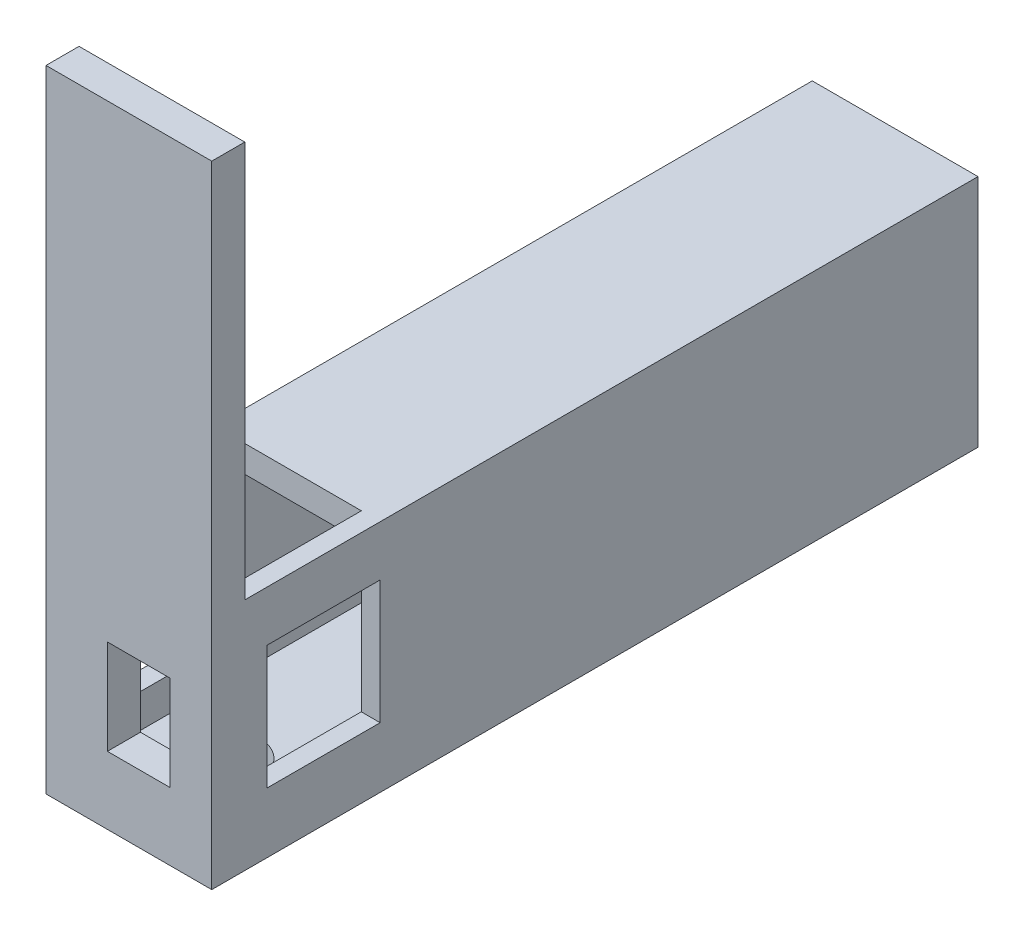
ISO-10303-21;
HEADER;
FILE_DESCRIPTION(('STEP AP214'),'2;1');
FILE_NAME('part.step','',(''),(''),'','','');
FILE_SCHEMA(('AUTOMOTIVE_DESIGN { 1 0 10303 214 1 1 1 1 }'));
ENDSEC;
DATA;
#1=APPLICATION_CONTEXT('core data for automotive mechanical design processes');
#2=APPLICATION_PROTOCOL_DEFINITION('international standard','automotive_design',2000,#1);
#3=PRODUCT_CONTEXT('',#1,'mechanical');
#4=PRODUCT('Part','Part','',(#3));
#5=PRODUCT_RELATED_PRODUCT_CATEGORY('part','',(#4));
#6=PRODUCT_DEFINITION_FORMATION('','',#4);
#7=PRODUCT_DEFINITION_CONTEXT('part definition',#1,'design');
#8=PRODUCT_DEFINITION('design','',#6,#7);
#9=PRODUCT_DEFINITION_SHAPE('','',#8);
#10=(LENGTH_UNIT() NAMED_UNIT(*) SI_UNIT(.MILLI.,.METRE.));
#11=(NAMED_UNIT(*) PLANE_ANGLE_UNIT() SI_UNIT($,.RADIAN.));
#12=(NAMED_UNIT(*) SI_UNIT($,.STERADIAN.) SOLID_ANGLE_UNIT());
#13=UNCERTAINTY_MEASURE_WITH_UNIT(LENGTH_MEASURE(1.E-05),#10,'distance_accuracy_value','');
#14=(GEOMETRIC_REPRESENTATION_CONTEXT(3) GLOBAL_UNCERTAINTY_ASSIGNED_CONTEXT((#13)) GLOBAL_UNIT_ASSIGNED_CONTEXT((#10,
#11,#12)) REPRESENTATION_CONTEXT('',''));
#15=CARTESIAN_POINT('',(0.,0.,0.));
#16=DIRECTION('',(0.,0.,1.));
#17=DIRECTION('',(1.,0.,0.));
#18=AXIS2_PLACEMENT_3D('',#15,#16,#17);
#19=CARTESIAN_POINT('',(24.554045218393,147.590841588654,-221.8957138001));
#20=DIRECTION('',(1.,0.,0.));
#21=DIRECTION('',(0.,1.,0.));
#22=AXIS2_PLACEMENT_3D('',#19,#20,#21);
#23=PLANE('',#22);
#24=DIRECTION('',(0.,1.,0.));
#25=VECTOR('',#24,1.);
#26=CARTESIAN_POINT('',(24.554045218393,147.590841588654,-40.9599363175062));
#27=LINE('',#26,#25);
#28=CARTESIAN_POINT('',(24.554045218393,165.867586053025,-40.9599363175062));
#29=VERTEX_POINT('',#28);
#30=CARTESIAN_POINT('',(24.554045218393,203.288707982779,-40.9599363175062));
#31=VERTEX_POINT('',#30);
#32=EDGE_CURVE('E289',#29,#31,#27,.T.);
#33=ORIENTED_EDGE('',*,*,#32,.F.);
#34=DIRECTION('',(0.,0.,-1.));
#35=VECTOR('',#34,1.);
#36=CARTESIAN_POINT('',(24.554045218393,165.867586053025,-221.8957138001));
#37=LINE('',#36,#35);
#38=CARTESIAN_POINT('',(24.554045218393,165.867586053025,-6.69277563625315));
#39=VERTEX_POINT('',#38);
#40=EDGE_CURVE('E342',#39,#29,#37,.T.);
#41=ORIENTED_EDGE('',*,*,#40,.F.);
#42=DIRECTION('',(0.,-1.,0.));
#43=VECTOR('',#42,1.);
#44=CARTESIAN_POINT('',(24.554045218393,147.590841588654,-6.69277563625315));
#45=LINE('',#44,#43);
#46=CARTESIAN_POINT('',(24.554045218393,203.288707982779,-6.69277563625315));
#47=VERTEX_POINT('',#46);
#48=EDGE_CURVE('E347',#47,#39,#45,.T.);
#49=ORIENTED_EDGE('',*,*,#48,.F.);
#50=DIRECTION('',(0.,0.,1.));
#51=VECTOR('',#50,1.);
#52=CARTESIAN_POINT('',(24.554045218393,203.288707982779,-221.8957138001));
#53=LINE('',#52,#51);
#54=EDGE_CURVE('E353',#31,#47,#53,.T.);
#55=ORIENTED_EDGE('',*,*,#54,.F.);
#56=EDGE_LOOP('',(#33,#41,#49,#55));
#57=FACE_BOUND('',#56,.T.);
#58=DIRECTION('',(0.,0.,1.));
#59=VECTOR('',#58,1.);
#60=CARTESIAN_POINT('',(24.554045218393,218.536949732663,-221.8957138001));
#61=LINE('',#60,#59);
#62=CARTESIAN_POINT('',(24.554045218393,218.536949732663,-221.8957138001));
#63=VERTEX_POINT('',#62);
#64=CARTESIAN_POINT('',(24.554045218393,218.536949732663,0.));
#65=VERTEX_POINT('',#64);
#66=EDGE_CURVE('E243',#63,#65,#61,.T.);
#67=ORIENTED_EDGE('',*,*,#66,.T.);
#68=DIRECTION('',(0.,-1.,0.));
#69=VECTOR('',#68,1.);
#70=CARTESIAN_POINT('',(24.554045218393,338.536949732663,0.));
#71=LINE('',#70,#69);
#72=CARTESIAN_POINT('',(24.554045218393,338.536949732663,0.));
#73=VERTEX_POINT('',#72);
#74=EDGE_CURVE('E248',#73,#65,#71,.T.);
#75=ORIENTED_EDGE('',*,*,#74,.F.);
#76=DIRECTION('',(0.,0.,-1.));
#77=VECTOR('',#76,1.);
#78=CARTESIAN_POINT('',(24.554045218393,338.536949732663,10.));
#79=LINE('',#78,#77);
#80=CARTESIAN_POINT('',(24.554045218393,338.536949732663,10.));
#81=VERTEX_POINT('',#80);
#82=EDGE_CURVE('E227',#81,#73,#79,.T.);
#83=ORIENTED_EDGE('',*,*,#82,.F.);
#84=DIRECTION('',(0.,1.,0.));
#85=VECTOR('',#84,1.);
#86=CARTESIAN_POINT('',(24.554045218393,218.536949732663,10.));
#87=LINE('',#86,#85);
#88=CARTESIAN_POINT('',(24.554045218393,147.590841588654,10.));
#89=VERTEX_POINT('',#88);
#90=EDGE_CURVE('E308',#89,#81,#87,.T.);
#91=ORIENTED_EDGE('',*,*,#90,.F.);
#92=DIRECTION('',(0.,0.,1.));
#93=VECTOR('',#92,1.);
#94=CARTESIAN_POINT('',(24.554045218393,147.590841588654,-221.8957138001));
#95=LINE('',#94,#93);
#96=CARTESIAN_POINT('',(24.554045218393,147.590841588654,-221.8957138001));
#97=VERTEX_POINT('',#96);
#98=EDGE_CURVE('E309',#97,#89,#95,.T.);
#99=ORIENTED_EDGE('',*,*,#98,.F.);
#100=DIRECTION('',(0.,1.,0.));
#101=VECTOR('',#100,1.);
#102=CARTESIAN_POINT('',(24.554045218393,147.590841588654,-221.8957138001));
#103=LINE('',#102,#101);
#104=EDGE_CURVE('E296',#97,#63,#103,.T.);
#105=ORIENTED_EDGE('',*,*,#104,.T.);
#106=EDGE_LOOP('',(#67,#75,#83,#91,#99,#105));
#107=FACE_BOUND('',#106,.T.);
#108=ADVANCED_FACE('F32',(#57,#107),#23,.T.);
#109=CARTESIAN_POINT('',(-25.6078665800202,147.590841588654,-221.8957138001));
#110=DIRECTION('',(0.,-1.,0.));
#111=DIRECTION('',(0.,0.,-1.));
#112=AXIS2_PLACEMENT_3D('',#109,#110,#111);
#113=PLANE('',#112);
#114=CARTESIAN_POINT('',(0.,147.590841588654,-18.05));
#115=DIRECTION('',(0.,-1.,0.));
#116=DIRECTION('',(0.,0.,-1.));
#117=AXIS2_PLACEMENT_3D('',#114,#115,#116);
#118=CIRCLE('',#117,10.8502852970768);
#119=CARTESIAN_POINT('',(0.,147.590841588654,-28.9002852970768));
#120=VERTEX_POINT('',#119);
#121=EDGE_CURVE('E359',#120,#120,#118,.T.);
#122=ORIENTED_EDGE('',*,*,#121,.F.);
#123=EDGE_LOOP('',(#122));
#124=FACE_BOUND('',#123,.T.);
#125=ORIENTED_EDGE('',*,*,#98,.T.);
#126=DIRECTION('',(1.,0.,0.));
#127=VECTOR('',#126,1.);
#128=CARTESIAN_POINT('',(-25.6078665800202,147.590841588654,10.));
#129=LINE('',#128,#127);
#130=CARTESIAN_POINT('',(-25.6078665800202,147.590841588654,10.));
#131=VERTEX_POINT('',#130);
#132=EDGE_CURVE('E312',#131,#89,#129,.T.);
#133=ORIENTED_EDGE('',*,*,#132,.F.);
#134=DIRECTION('',(0.,0.,1.));
#135=VECTOR('',#134,1.);
#136=CARTESIAN_POINT('',(-25.6078665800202,147.590841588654,-221.8957138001));
#137=LINE('',#136,#135);
#138=CARTESIAN_POINT('',(-25.6078665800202,147.590841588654,-221.8957138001));
#139=VERTEX_POINT('',#138);
#140=EDGE_CURVE('E400',#139,#131,#137,.T.);
#141=ORIENTED_EDGE('',*,*,#140,.F.);
#142=DIRECTION('',(1.,0.,0.));
#143=VECTOR('',#142,1.);
#144=CARTESIAN_POINT('',(-25.6078665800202,147.590841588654,-221.8957138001));
#145=LINE('',#144,#143);
#146=EDGE_CURVE('E301',#139,#97,#145,.T.);
#147=ORIENTED_EDGE('',*,*,#146,.T.);
#148=EDGE_LOOP('',(#125,#133,#141,#147));
#149=FACE_BOUND('',#148,.T.);
#150=ADVANCED_FACE('F277',(#124,#149),#113,.T.);
#151=CARTESIAN_POINT('',(-25.6078665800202,147.590841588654,-221.8957138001));
#152=DIRECTION('',(-1.,0.,0.));
#153=DIRECTION('',(0.,0.,1.));
#154=AXIS2_PLACEMENT_3D('',#151,#152,#153);
#155=PLANE('',#154);
#156=DIRECTION('',(0.,-1.,0.));
#157=VECTOR('',#156,1.);
#158=CARTESIAN_POINT('',(-25.6078665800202,165.867586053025,-40.9599363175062));
#159=LINE('',#158,#157);
#160=CARTESIAN_POINT('',(-25.6078665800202,203.288707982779,-40.9599363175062));
#161=VERTEX_POINT('',#160);
#162=CARTESIAN_POINT('',(-25.6078665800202,165.867586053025,-40.9599363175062));
#163=VERTEX_POINT('',#162);
#164=EDGE_CURVE('E311',#161,#163,#159,.T.);
#165=ORIENTED_EDGE('',*,*,#164,.F.);
#166=DIRECTION('',(0.,0.,-1.));
#167=VECTOR('',#166,1.);
#168=CARTESIAN_POINT('',(-25.6078665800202,203.288707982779,-40.9599363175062));
#169=LINE('',#168,#167);
#170=CARTESIAN_POINT('',(-25.6078665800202,203.288707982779,-6.69277563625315));
#171=VERTEX_POINT('',#170);
#172=EDGE_CURVE('E323',#171,#161,#169,.T.);
#173=ORIENTED_EDGE('',*,*,#172,.F.);
#174=DIRECTION('',(0.,1.,0.));
#175=VECTOR('',#174,1.);
#176=CARTESIAN_POINT('',(-25.6078665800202,165.867586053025,-6.69277563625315));
#177=LINE('',#176,#175);
#178=CARTESIAN_POINT('',(-25.6078665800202,165.867586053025,-6.69277563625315));
#179=VERTEX_POINT('',#178);
#180=EDGE_CURVE('E320',#179,#171,#177,.T.);
#181=ORIENTED_EDGE('',*,*,#180,.F.);
#182=DIRECTION('',(0.,0.,1.));
#183=VECTOR('',#182,1.);
#184=CARTESIAN_POINT('',(-25.6078665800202,165.867586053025,-40.9599363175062));
#185=LINE('',#184,#183);
#186=EDGE_CURVE('E314',#163,#179,#185,.T.);
#187=ORIENTED_EDGE('',*,*,#186,.F.);
#188=EDGE_LOOP('',(#165,#173,#181,#187));
#189=FACE_BOUND('',#188,.T.);
#190=ORIENTED_EDGE('',*,*,#140,.T.);
#191=DIRECTION('',(0.,-1.,0.));
#192=VECTOR('',#191,1.);
#193=CARTESIAN_POINT('',(-25.6078665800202,218.536949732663,10.));
#194=LINE('',#193,#192);
#195=CARTESIAN_POINT('',(-25.6078665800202,338.536949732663,10.));
#196=VERTEX_POINT('',#195);
#197=EDGE_CURVE('E253',#196,#131,#194,.T.);
#198=ORIENTED_EDGE('',*,*,#197,.F.);
#199=DIRECTION('',(0.,0.,1.));
#200=VECTOR('',#199,1.);
#201=CARTESIAN_POINT('',(-25.6078665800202,338.536949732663,10.));
#202=LINE('',#201,#200);
#203=CARTESIAN_POINT('',(-25.6078665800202,338.536949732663,0.));
#204=VERTEX_POINT('',#203);
#205=EDGE_CURVE('E221',#204,#196,#202,.T.);
#206=ORIENTED_EDGE('',*,*,#205,.F.);
#207=DIRECTION('',(0.,-1.,0.));
#208=VECTOR('',#207,1.);
#209=CARTESIAN_POINT('',(-25.6078665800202,338.536949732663,0.));
#210=LINE('',#209,#208);
#211=CARTESIAN_POINT('',(-25.6078665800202,218.536949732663,0.));
#212=VERTEX_POINT('',#211);
#213=EDGE_CURVE('E231',#204,#212,#210,.T.);
#214=ORIENTED_EDGE('',*,*,#213,.T.);
#215=DIRECTION('',(0.,0.,1.));
#216=VECTOR('',#215,1.);
#217=CARTESIAN_POINT('',(-25.6078665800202,218.536949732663,-221.8957138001));
#218=LINE('',#217,#216);
#219=CARTESIAN_POINT('',(-25.6078665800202,218.536949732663,-221.8957138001));
#220=VERTEX_POINT('',#219);
#221=EDGE_CURVE('E300',#220,#212,#218,.T.);
#222=ORIENTED_EDGE('',*,*,#221,.F.);
#223=DIRECTION('',(0.,-1.,0.));
#224=VECTOR('',#223,1.);
#225=CARTESIAN_POINT('',(-25.6078665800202,147.590841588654,-221.8957138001));
#226=LINE('',#225,#224);
#227=EDGE_CURVE('E451',#220,#139,#226,.T.);
#228=ORIENTED_EDGE('',*,*,#227,.T.);
#229=EDGE_LOOP('',(#190,#198,#206,#214,#222,#228));
#230=FACE_BOUND('',#229,.T.);
#231=ADVANCED_FACE('F282',(#189,#230),#155,.T.);
#232=CARTESIAN_POINT('',(-25.6078665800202,218.536949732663,-221.8957138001));
#233=DIRECTION('',(0.,1.,0.));
#234=DIRECTION('',(0.,0.,1.));
#235=AXIS2_PLACEMENT_3D('',#232,#233,#234);
#236=PLANE('',#235);
#237=DIRECTION('',(-1.,0.,0.));
#238=VECTOR('',#237,1.);
#239=CARTESIAN_POINT('',(-25.6078665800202,218.536949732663,0.));
#240=LINE('',#239,#238);
#241=CARTESIAN_POINT('',(18.8431850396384,218.536949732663,0.));
#242=VERTEX_POINT('',#241);
#243=EDGE_CURVE('E218',#65,#242,#240,.T.);
#244=ORIENTED_EDGE('',*,*,#243,.F.);
#245=ORIENTED_EDGE('',*,*,#66,.F.);
#246=DIRECTION('',(-1.,0.,0.));
#247=VECTOR('',#246,1.);
#248=CARTESIAN_POINT('',(-25.6078665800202,218.536949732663,-221.8957138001));
#249=LINE('',#248,#247);
#250=EDGE_CURVE('E449',#63,#220,#249,.T.);
#251=ORIENTED_EDGE('',*,*,#250,.T.);
#252=ORIENTED_EDGE('',*,*,#221,.T.);
#253=CARTESIAN_POINT('',(-19.8970064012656,218.536949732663,0.));
#254=VERTEX_POINT('',#253);
#255=EDGE_CURVE('E237',#254,#212,#240,.T.);
#256=ORIENTED_EDGE('',*,*,#255,.F.);
#257=DIRECTION('',(0.,0.,1.));
#258=VECTOR('',#257,1.);
#259=CARTESIAN_POINT('',(-19.8970064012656,218.536949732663,0.));
#260=LINE('',#259,#258);
#261=CARTESIAN_POINT('',(-19.8970064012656,218.536949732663,-41.));
#262=VERTEX_POINT('',#261);
#263=EDGE_CURVE('E397',#262,#254,#260,.T.);
#264=ORIENTED_EDGE('',*,*,#263,.F.);
#265=DIRECTION('',(-1.,0.,0.));
#266=VECTOR('',#265,1.);
#267=CARTESIAN_POINT('',(-19.8970064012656,218.536949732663,-41.));
#268=LINE('',#267,#266);
#269=CARTESIAN_POINT('',(18.8431850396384,218.536949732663,-41.));
#270=VERTEX_POINT('',#269);
#271=EDGE_CURVE('E363',#270,#262,#268,.T.);
#272=ORIENTED_EDGE('',*,*,#271,.F.);
#273=DIRECTION('',(0.,0.,-1.));
#274=VECTOR('',#273,1.);
#275=CARTESIAN_POINT('',(18.8431850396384,218.536949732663,0.));
#276=LINE('',#275,#274);
#277=EDGE_CURVE('E367',#242,#270,#276,.T.);
#278=ORIENTED_EDGE('',*,*,#277,.F.);
#279=EDGE_LOOP('',(#244,#245,#251,#252,#256,#264,#272,#278));
#280=FACE_BOUND('',#279,.T.);
#281=ADVANCED_FACE('F432',(#280),#236,.T.);
#282=CARTESIAN_POINT('',(24.554045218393,218.536949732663,-221.8957138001));
#283=DIRECTION('',(0.,0.,-1.));
#284=DIRECTION('',(-1.,0.,0.));
#285=AXIS2_PLACEMENT_3D('',#282,#283,#284);
#286=PLANE('',#285);
#287=DIRECTION('',(0.,1.,0.));
#288=VECTOR('',#287,1.);
#289=CARTESIAN_POINT('',(18.8431850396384,155.6679520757,-221.8957138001));
#290=LINE('',#289,#288);
#291=CARTESIAN_POINT('',(18.8431850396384,155.6679520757,-221.8957138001));
#292=VERTEX_POINT('',#291);
#293=CARTESIAN_POINT('',(18.8431850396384,210.459839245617,-221.8957138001));
#294=VERTEX_POINT('',#293);
#295=EDGE_CURVE('E372',#292,#294,#290,.T.);
#296=ORIENTED_EDGE('',*,*,#295,.T.);
#297=DIRECTION('',(-1.,0.,0.));
#298=VECTOR('',#297,1.);
#299=CARTESIAN_POINT('',(-19.8970064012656,210.459839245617,-221.8957138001));
#300=LINE('',#299,#298);
#301=CARTESIAN_POINT('',(-19.8970064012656,210.459839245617,-221.8957138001));
#302=VERTEX_POINT('',#301);
#303=EDGE_CURVE('E375',#294,#302,#300,.T.);
#304=ORIENTED_EDGE('',*,*,#303,.T.);
#305=DIRECTION('',(0.,-1.,0.));
#306=VECTOR('',#305,1.);
#307=CARTESIAN_POINT('',(-19.8970064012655,155.6679520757,-221.8957138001));
#308=LINE('',#307,#306);
#309=CARTESIAN_POINT('',(-19.8970064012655,155.6679520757,-221.8957138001));
#310=VERTEX_POINT('',#309);
#311=EDGE_CURVE('E379',#302,#310,#308,.T.);
#312=ORIENTED_EDGE('',*,*,#311,.T.);
#313=DIRECTION('',(1.,0.,0.));
#314=VECTOR('',#313,1.);
#315=CARTESIAN_POINT('',(-19.8970064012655,155.6679520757,-221.8957138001));
#316=LINE('',#315,#314);
#317=EDGE_CURVE('E382',#310,#292,#316,.T.);
#318=ORIENTED_EDGE('',*,*,#317,.T.);
#319=EDGE_LOOP('',(#296,#304,#312,#318));
#320=FACE_BOUND('',#319,.T.);
#321=ORIENTED_EDGE('',*,*,#104,.F.);
#322=ORIENTED_EDGE('',*,*,#146,.F.);
#323=ORIENTED_EDGE('',*,*,#227,.F.);
#324=ORIENTED_EDGE('',*,*,#250,.F.);
#325=EDGE_LOOP('',(#321,#322,#323,#324));
#326=FACE_BOUND('',#325,.T.);
#327=ADVANCED_FACE('F509',(#320,#326),#286,.T.);
#328=CARTESIAN_POINT('',(18.8431850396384,155.6679520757,-221.8957138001));
#329=DIRECTION('',(1.,0.,0.));
#330=DIRECTION('',(0.,0.,-1.));
#331=AXIS2_PLACEMENT_3D('',#328,#329,#330);
#332=PLANE('',#331);
#333=DIRECTION('',(0.,0.,-1.));
#334=VECTOR('',#333,1.);
#335=CARTESIAN_POINT('',(18.8431850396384,165.867586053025,-221.8957138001));
#336=LINE('',#335,#334);
#337=CARTESIAN_POINT('',(18.8431850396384,165.867586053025,-6.69277563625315));
#338=VERTEX_POINT('',#337);
#339=CARTESIAN_POINT('',(18.8431850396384,165.867586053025,-40.9599363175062));
#340=VERTEX_POINT('',#339);
#341=EDGE_CURVE('E339',#338,#340,#336,.T.);
#342=ORIENTED_EDGE('',*,*,#341,.T.);
#343=DIRECTION('',(0.,1.,0.));
#344=VECTOR('',#343,1.);
#345=CARTESIAN_POINT('',(18.8431850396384,155.6679520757,-40.9599363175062));
#346=LINE('',#345,#344);
#347=CARTESIAN_POINT('',(18.8431850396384,203.288707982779,-40.9599363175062));
#348=VERTEX_POINT('',#347);
#349=EDGE_CURVE('E355',#340,#348,#346,.T.);
#350=ORIENTED_EDGE('',*,*,#349,.T.);
#351=DIRECTION('',(0.,0.,1.));
#352=VECTOR('',#351,1.);
#353=CARTESIAN_POINT('',(18.8431850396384,203.288707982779,-221.8957138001));
#354=LINE('',#353,#352);
#355=CARTESIAN_POINT('',(18.8431850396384,203.288707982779,-6.69277563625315));
#356=VERTEX_POINT('',#355);
#357=EDGE_CURVE('E350',#348,#356,#354,.T.);
#358=ORIENTED_EDGE('',*,*,#357,.T.);
#359=DIRECTION('',(0.,-1.,0.));
#360=VECTOR('',#359,1.);
#361=CARTESIAN_POINT('',(18.8431850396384,155.6679520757,-6.69277563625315));
#362=LINE('',#361,#360);
#363=EDGE_CURVE('E344',#356,#338,#362,.T.);
#364=ORIENTED_EDGE('',*,*,#363,.T.);
#365=EDGE_LOOP('',(#342,#350,#358,#364));
#366=FACE_BOUND('',#365,.T.);
#367=DIRECTION('',(0.,1.,0.));
#368=VECTOR('',#367,1.);
#369=CARTESIAN_POINT('',(18.8431850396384,192.656285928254,-41.));
#370=LINE('',#369,#368);
#371=CARTESIAN_POINT('',(18.8431850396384,210.459839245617,-41.));
#372=VERTEX_POINT('',#371);
#373=EDGE_CURVE('E366',#372,#270,#370,.T.);
#374=ORIENTED_EDGE('',*,*,#373,.F.);
#375=DIRECTION('',(0.,0.,1.));
#376=VECTOR('',#375,1.);
#377=CARTESIAN_POINT('',(18.8431850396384,210.459839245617,-221.8957138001));
#378=LINE('',#377,#376);
#379=EDGE_CURVE('E385',#294,#372,#378,.T.);
#380=ORIENTED_EDGE('',*,*,#379,.F.);
#381=ORIENTED_EDGE('',*,*,#295,.F.);
#382=DIRECTION('',(0.,0.,1.));
#383=VECTOR('',#382,1.);
#384=CARTESIAN_POINT('',(18.8431850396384,155.6679520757,-221.8957138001));
#385=LINE('',#384,#383);
#386=CARTESIAN_POINT('',(18.8431850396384,155.6679520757,0.));
#387=VERTEX_POINT('',#386);
#388=EDGE_CURVE('E439',#292,#387,#385,.T.);
#389=ORIENTED_EDGE('',*,*,#388,.T.);
#390=DIRECTION('',(0.,1.,0.));
#391=VECTOR('',#390,1.);
#392=CARTESIAN_POINT('',(18.8431850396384,155.6679520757,0.));
#393=LINE('',#392,#391);
#394=EDGE_CURVE('E370',#387,#242,#393,.T.);
#395=ORIENTED_EDGE('',*,*,#394,.T.);
#396=ORIENTED_EDGE('',*,*,#277,.T.);
#397=EDGE_LOOP('',(#374,#380,#381,#389,#395,#396));
#398=FACE_BOUND('',#397,.T.);
#399=ADVANCED_FACE('F499',(#366,#398),#332,.F.);
#400=CARTESIAN_POINT('',(-19.8970064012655,155.6679520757,-221.8957138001));
#401=DIRECTION('',(0.,-1.,0.));
#402=DIRECTION('',(0.,0.,-1.));
#403=AXIS2_PLACEMENT_3D('',#400,#401,#402);
#404=PLANE('',#403);
#405=CARTESIAN_POINT('',(0.,155.6679520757,-18.05));
#406=DIRECTION('',(0.,-1.,0.));
#407=DIRECTION('',(0.,0.,-1.));
#408=AXIS2_PLACEMENT_3D('',#405,#406,#407);
#409=CIRCLE('',#408,10.8502852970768);
#410=CARTESIAN_POINT('',(0.,155.6679520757,-28.9002852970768));
#411=VERTEX_POINT('',#410);
#412=EDGE_CURVE('E362',#411,#411,#409,.T.);
#413=ORIENTED_EDGE('',*,*,#412,.T.);
#414=EDGE_LOOP('',(#413));
#415=FACE_BOUND('',#414,.T.);
#416=DIRECTION('',(1.,0.,0.));
#417=VECTOR('',#416,1.);
#418=CARTESIAN_POINT('',(-19.8970064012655,155.6679520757,0.));
#419=LINE('',#418,#417);
#420=CARTESIAN_POINT('',(-19.8970064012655,155.6679520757,0.));
#421=VERTEX_POINT('',#420);
#422=EDGE_CURVE('E376',#421,#387,#419,.T.);
#423=ORIENTED_EDGE('',*,*,#422,.T.);
#424=ORIENTED_EDGE('',*,*,#388,.F.);
#425=ORIENTED_EDGE('',*,*,#317,.F.);
#426=DIRECTION('',(0.,0.,1.));
#427=VECTOR('',#426,1.);
#428=CARTESIAN_POINT('',(-19.8970064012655,155.6679520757,-221.8957138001));
#429=LINE('',#428,#427);
#430=EDGE_CURVE('E441',#310,#421,#429,.T.);
#431=ORIENTED_EDGE('',*,*,#430,.T.);
#432=EDGE_LOOP('',(#423,#424,#425,#431));
#433=FACE_BOUND('',#432,.T.);
#434=ADVANCED_FACE('F437',(#415,#433),#404,.F.);
#435=CARTESIAN_POINT('',(-19.8970064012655,155.6679520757,-221.8957138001));
#436=DIRECTION('',(-1.,0.,0.));
#437=DIRECTION('',(0.,-1.,0.));
#438=AXIS2_PLACEMENT_3D('',#435,#436,#437);
#439=PLANE('',#438);
#440=DIRECTION('',(0.,0.,-1.));
#441=VECTOR('',#440,1.);
#442=CARTESIAN_POINT('',(-19.8970064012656,203.288707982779,-221.8957138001));
#443=LINE('',#442,#441);
#444=CARTESIAN_POINT('',(-19.8970064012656,203.288707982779,-6.69277563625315));
#445=VERTEX_POINT('',#444);
#446=CARTESIAN_POINT('',(-19.8970064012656,203.288707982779,-40.9599363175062));
#447=VERTEX_POINT('',#446);
#448=EDGE_CURVE('E417',#445,#447,#443,.T.);
#449=ORIENTED_EDGE('',*,*,#448,.T.);
#450=DIRECTION('',(0.,-1.,0.));
#451=VECTOR('',#450,1.);
#452=CARTESIAN_POINT('',(-19.8970064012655,155.6679520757,-40.9599363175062));
#453=LINE('',#452,#451);
#454=CARTESIAN_POINT('',(-19.8970064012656,165.867586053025,-40.9599363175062));
#455=VERTEX_POINT('',#454);
#456=EDGE_CURVE('E242',#447,#455,#453,.T.);
#457=ORIENTED_EDGE('',*,*,#456,.T.);
#458=DIRECTION('',(0.,0.,1.));
#459=VECTOR('',#458,1.);
#460=CARTESIAN_POINT('',(-19.8970064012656,165.867586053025,-221.8957138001));
#461=LINE('',#460,#459);
#462=CARTESIAN_POINT('',(-19.8970064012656,165.867586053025,-6.69277563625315));
#463=VERTEX_POINT('',#462);
#464=EDGE_CURVE('E409',#455,#463,#461,.T.);
#465=ORIENTED_EDGE('',*,*,#464,.T.);
#466=DIRECTION('',(0.,1.,0.));
#467=VECTOR('',#466,1.);
#468=CARTESIAN_POINT('',(-19.8970064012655,155.6679520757,-6.69277563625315));
#469=LINE('',#468,#467);
#470=EDGE_CURVE('E414',#463,#445,#469,.T.);
#471=ORIENTED_EDGE('',*,*,#470,.T.);
#472=EDGE_LOOP('',(#449,#457,#465,#471));
#473=FACE_BOUND('',#472,.T.);
#474=DIRECTION('',(0.,0.,1.));
#475=VECTOR('',#474,1.);
#476=CARTESIAN_POINT('',(-19.8970064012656,210.459839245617,-221.8957138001));
#477=LINE('',#476,#475);
#478=CARTESIAN_POINT('',(-19.8970064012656,210.459839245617,-41.));
#479=VERTEX_POINT('',#478);
#480=EDGE_CURVE('E442',#302,#479,#477,.T.);
#481=ORIENTED_EDGE('',*,*,#480,.T.);
#482=DIRECTION('',(0.,1.,0.));
#483=VECTOR('',#482,1.);
#484=CARTESIAN_POINT('',(-19.8970064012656,192.656285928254,-41.));
#485=LINE('',#484,#483);
#486=EDGE_CURVE('E368',#479,#262,#485,.T.);
#487=ORIENTED_EDGE('',*,*,#486,.T.);
#488=ORIENTED_EDGE('',*,*,#263,.T.);
#489=DIRECTION('',(0.,-1.,0.));
#490=VECTOR('',#489,1.);
#491=CARTESIAN_POINT('',(-19.8970064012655,155.6679520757,0.));
#492=LINE('',#491,#490);
#493=EDGE_CURVE('E392',#254,#421,#492,.T.);
#494=ORIENTED_EDGE('',*,*,#493,.T.);
#495=ORIENTED_EDGE('',*,*,#430,.F.);
#496=ORIENTED_EDGE('',*,*,#311,.F.);
#497=EDGE_LOOP('',(#481,#487,#488,#494,#495,#496));
#498=FACE_BOUND('',#497,.T.);
#499=ADVANCED_FACE('F429',(#473,#498),#439,.F.);
#500=CARTESIAN_POINT('',(-19.8970064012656,210.459839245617,-221.8957138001));
#501=DIRECTION('',(0.,1.,0.));
#502=DIRECTION('',(0.,0.,1.));
#503=AXIS2_PLACEMENT_3D('',#500,#501,#502);
#504=PLANE('',#503);
#505=ORIENTED_EDGE('',*,*,#379,.T.);
#506=DIRECTION('',(-1.,0.,0.));
#507=VECTOR('',#506,1.);
#508=CARTESIAN_POINT('',(-19.8970064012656,210.459839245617,-41.));
#509=LINE('',#508,#507);
#510=EDGE_CURVE('E406',#372,#479,#509,.T.);
#511=ORIENTED_EDGE('',*,*,#510,.T.);
#512=ORIENTED_EDGE('',*,*,#480,.F.);
#513=ORIENTED_EDGE('',*,*,#303,.F.);
#514=EDGE_LOOP('',(#505,#511,#512,#513));
#515=FACE_BOUND('',#514,.T.);
#516=ADVANCED_FACE('F495',(#515),#504,.F.);
#517=CARTESIAN_POINT('',(-19.8970064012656,192.656285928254,-41.));
#518=DIRECTION('',(0.,0.,-1.));
#519=DIRECTION('',(-1.,0.,0.));
#520=AXIS2_PLACEMENT_3D('',#517,#518,#519);
#521=PLANE('',#520);
#522=ORIENTED_EDGE('',*,*,#373,.T.);
#523=ORIENTED_EDGE('',*,*,#271,.T.);
#524=ORIENTED_EDGE('',*,*,#486,.F.);
#525=ORIENTED_EDGE('',*,*,#510,.F.);
#526=EDGE_LOOP('',(#522,#523,#524,#525));
#527=FACE_BOUND('',#526,.T.);
#528=ADVANCED_FACE('F491',(#527),#521,.F.);
#529=CARTESIAN_POINT('',(0.,165.990841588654,-18.05));
#530=DIRECTION('',(0.,-1.,0.));
#531=DIRECTION('',(0.,0.,-1.));
#532=AXIS2_PLACEMENT_3D('',#529,#530,#531);
#533=CYLINDRICAL_SURFACE('',#532,10.8502852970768);
#534=ORIENTED_EDGE('',*,*,#121,.T.);
#535=EDGE_LOOP('',(#534));
#536=FACE_BOUND('',#535,.T.);
#537=ORIENTED_EDGE('',*,*,#412,.F.);
#538=EDGE_LOOP('',(#537));
#539=FACE_BOUND('',#538,.T.);
#540=ADVANCED_FACE('F488',(#536,#539),#533,.F.);
#541=CARTESIAN_POINT('',(85.9921334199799,165.867586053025,-40.9599363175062));
#542=DIRECTION('',(0.,-1.,0.));
#543=DIRECTION('',(0.,0.,-1.));
#544=AXIS2_PLACEMENT_3D('',#541,#542,#543);
#545=PLANE('',#544);
#546=DIRECTION('',(-1.,0.,0.));
#547=VECTOR('',#546,1.);
#548=CARTESIAN_POINT('',(85.9921334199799,165.867586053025,-40.9599363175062));
#549=LINE('',#548,#547);
#550=EDGE_CURVE('E326',#455,#163,#549,.T.);
#551=ORIENTED_EDGE('',*,*,#550,.T.);
#552=ORIENTED_EDGE('',*,*,#186,.T.);
#553=DIRECTION('',(-1.,0.,0.));
#554=VECTOR('',#553,1.);
#555=CARTESIAN_POINT('',(85.9921334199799,165.867586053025,-6.69277563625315));
#556=LINE('',#555,#554);
#557=EDGE_CURVE('E334',#463,#179,#556,.T.);
#558=ORIENTED_EDGE('',*,*,#557,.F.);
#559=ORIENTED_EDGE('',*,*,#464,.F.);
#560=EDGE_LOOP('',(#551,#552,#558,#559));
#561=FACE_BOUND('',#560,.T.);
#562=ADVANCED_FACE('F472',(#561),#545,.F.);
#563=CARTESIAN_POINT('',(85.9921334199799,165.867586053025,-6.69277563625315));
#564=DIRECTION('',(0.,0.,1.));
#565=DIRECTION('',(1.,0.,0.));
#566=AXIS2_PLACEMENT_3D('',#563,#564,#565);
#567=PLANE('',#566);
#568=ORIENTED_EDGE('',*,*,#557,.T.);
#569=ORIENTED_EDGE('',*,*,#180,.T.);
#570=DIRECTION('',(-1.,0.,0.));
#571=VECTOR('',#570,1.);
#572=CARTESIAN_POINT('',(85.9921334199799,203.288707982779,-6.69277563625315));
#573=LINE('',#572,#571);
#574=EDGE_CURVE('E331',#445,#171,#573,.T.);
#575=ORIENTED_EDGE('',*,*,#574,.F.);
#576=ORIENTED_EDGE('',*,*,#470,.F.);
#577=EDGE_LOOP('',(#568,#569,#575,#576));
#578=FACE_BOUND('',#577,.T.);
#579=ADVANCED_FACE('F482',(#578),#567,.F.);
#580=CARTESIAN_POINT('',(85.9921334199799,203.288707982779,-40.9599363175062));
#581=DIRECTION('',(0.,1.,0.));
#582=DIRECTION('',(0.,0.,1.));
#583=AXIS2_PLACEMENT_3D('',#580,#581,#582);
#584=PLANE('',#583);
#585=ORIENTED_EDGE('',*,*,#574,.T.);
#586=ORIENTED_EDGE('',*,*,#172,.T.);
#587=DIRECTION('',(-1.,0.,0.));
#588=VECTOR('',#587,1.);
#589=CARTESIAN_POINT('',(85.9921334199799,203.288707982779,-40.9599363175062));
#590=LINE('',#589,#588);
#591=EDGE_CURVE('E327',#447,#161,#590,.T.);
#592=ORIENTED_EDGE('',*,*,#591,.F.);
#593=ORIENTED_EDGE('',*,*,#448,.F.);
#594=EDGE_LOOP('',(#585,#586,#592,#593));
#595=FACE_BOUND('',#594,.T.);
#596=ADVANCED_FACE('F479',(#595),#584,.F.);
#597=CARTESIAN_POINT('',(85.9921334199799,165.867586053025,-40.9599363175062));
#598=DIRECTION('',(0.,0.,-1.));
#599=DIRECTION('',(-1.,0.,0.));
#600=AXIS2_PLACEMENT_3D('',#597,#598,#599);
#601=PLANE('',#600);
#602=ORIENTED_EDGE('',*,*,#591,.T.);
#603=ORIENTED_EDGE('',*,*,#164,.T.);
#604=ORIENTED_EDGE('',*,*,#550,.F.);
#605=ORIENTED_EDGE('',*,*,#456,.F.);
#606=EDGE_LOOP('',(#602,#603,#604,#605));
#607=FACE_BOUND('',#606,.T.);
#608=ADVANCED_FACE('F486',(#607),#601,.F.);
#609=ORIENTED_EDGE('',*,*,#32,.T.);
#610=EDGE_CURVE('E329',#31,#348,#590,.T.);
#611=ORIENTED_EDGE('',*,*,#610,.T.);
#612=ORIENTED_EDGE('',*,*,#349,.F.);
#613=EDGE_CURVE('E336',#29,#340,#549,.T.);
#614=ORIENTED_EDGE('',*,*,#613,.F.);
#615=EDGE_LOOP('',(#609,#611,#612,#614));
#616=FACE_BOUND('',#615,.T.);
#617=ADVANCED_FACE('F477',(#616),#601,.F.);
#618=ORIENTED_EDGE('',*,*,#54,.T.);
#619=EDGE_CURVE('E330',#47,#356,#573,.T.);
#620=ORIENTED_EDGE('',*,*,#619,.T.);
#621=ORIENTED_EDGE('',*,*,#357,.F.);
#622=ORIENTED_EDGE('',*,*,#610,.F.);
#623=EDGE_LOOP('',(#618,#620,#621,#622));
#624=FACE_BOUND('',#623,.T.);
#625=ADVANCED_FACE('F474',(#624),#584,.F.);
#626=ORIENTED_EDGE('',*,*,#48,.T.);
#627=EDGE_CURVE('E333',#39,#338,#556,.T.);
#628=ORIENTED_EDGE('',*,*,#627,.T.);
#629=ORIENTED_EDGE('',*,*,#363,.F.);
#630=ORIENTED_EDGE('',*,*,#619,.F.);
#631=EDGE_LOOP('',(#626,#628,#629,#630));
#632=FACE_BOUND('',#631,.T.);
#633=ADVANCED_FACE('F469',(#632),#567,.F.);
#634=ORIENTED_EDGE('',*,*,#40,.T.);
#635=ORIENTED_EDGE('',*,*,#613,.T.);
#636=ORIENTED_EDGE('',*,*,#341,.F.);
#637=ORIENTED_EDGE('',*,*,#627,.F.);
#638=EDGE_LOOP('',(#634,#635,#636,#637));
#639=FACE_BOUND('',#638,.T.);
#640=ADVANCED_FACE('F462',(#639),#545,.F.);
#641=CARTESIAN_POINT('',(-25.6078665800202,147.590841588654,10.));
#642=DIRECTION('',(0.,0.,1.));
#643=DIRECTION('',(1.,0.,0.));
#644=AXIS2_PLACEMENT_3D('',#641,#642,#643);
#645=PLANE('',#644);
#646=DIRECTION('',(0.,-1.,0.));
#647=VECTOR('',#646,1.);
#648=CARTESIAN_POINT('',(-7.02899912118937,168.053753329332,10.));
#649=LINE('',#648,#647);
#650=CARTESIAN_POINT('',(-7.02899912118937,196.723669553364,10.));
#651=VERTEX_POINT('',#650);
#652=CARTESIAN_POINT('',(-7.02899912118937,168.053753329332,10.));
#653=VERTEX_POINT('',#652);
#654=EDGE_CURVE('E46',#651,#653,#649,.T.);
#655=ORIENTED_EDGE('',*,*,#654,.F.);
#656=DIRECTION('',(-1.,0.,0.));
#657=VECTOR('',#656,1.);
#658=CARTESIAN_POINT('',(-7.02899912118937,196.723669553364,10.));
#659=LINE('',#658,#657);
#660=CARTESIAN_POINT('',(11.9813361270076,196.723669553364,10.));
#661=VERTEX_POINT('',#660);
#662=EDGE_CURVE('E211',#661,#651,#659,.T.);
#663=ORIENTED_EDGE('',*,*,#662,.F.);
#664=DIRECTION('',(0.,1.,0.));
#665=VECTOR('',#664,1.);
#666=CARTESIAN_POINT('',(11.9813361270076,168.053753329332,10.));
#667=LINE('',#666,#665);
#668=CARTESIAN_POINT('',(11.9813361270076,168.053753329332,10.));
#669=VERTEX_POINT('',#668);
#670=EDGE_CURVE('E195',#669,#661,#667,.T.);
#671=ORIENTED_EDGE('',*,*,#670,.F.);
#672=DIRECTION('',(1.,0.,0.));
#673=VECTOR('',#672,1.);
#674=CARTESIAN_POINT('',(-7.02899912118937,168.053753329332,10.));
#675=LINE('',#674,#673);
#676=EDGE_CURVE('E204',#653,#669,#675,.T.);
#677=ORIENTED_EDGE('',*,*,#676,.F.);
#678=EDGE_LOOP('',(#655,#663,#671,#677));
#679=FACE_BOUND('',#678,.T.);
#680=ORIENTED_EDGE('',*,*,#197,.T.);
#681=ORIENTED_EDGE('',*,*,#132,.T.);
#682=ORIENTED_EDGE('',*,*,#90,.T.);
#683=DIRECTION('',(1.,0.,0.));
#684=VECTOR('',#683,1.);
#685=CARTESIAN_POINT('',(-25.6078665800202,338.536949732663,10.));
#686=LINE('',#685,#684);
#687=EDGE_CURVE('E224',#196,#81,#686,.T.);
#688=ORIENTED_EDGE('',*,*,#687,.F.);
#689=EDGE_LOOP('',(#680,#681,#682,#688));
#690=FACE_BOUND('',#689,.T.);
#691=ADVANCED_FACE('F208',(#679,#690),#645,.T.);
#692=CARTESIAN_POINT('',(-25.6078665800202,147.590841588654,0.));
#693=DIRECTION('',(0.,0.,1.));
#694=DIRECTION('',(1.,0.,0.));
#695=AXIS2_PLACEMENT_3D('',#692,#693,#694);
#696=PLANE('',#695);
#697=DIRECTION('',(-1.,0.,0.));
#698=VECTOR('',#697,1.);
#699=CARTESIAN_POINT('',(-25.6078665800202,196.723669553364,0.));
#700=LINE('',#699,#698);
#701=CARTESIAN_POINT('',(11.9813361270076,196.723669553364,0.));
#702=VERTEX_POINT('',#701);
#703=CARTESIAN_POINT('',(-7.02899912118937,196.723669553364,0.));
#704=VERTEX_POINT('',#703);
#705=EDGE_CURVE('E39',#702,#704,#700,.T.);
#706=ORIENTED_EDGE('',*,*,#705,.T.);
#707=DIRECTION('',(0.,-1.,0.));
#708=VECTOR('',#707,1.);
#709=CARTESIAN_POINT('',(-7.02899912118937,147.590841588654,0.));
#710=LINE('',#709,#708);
#711=CARTESIAN_POINT('',(-7.02899912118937,168.053753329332,0.));
#712=VERTEX_POINT('',#711);
#713=EDGE_CURVE('E11',#704,#712,#710,.T.);
#714=ORIENTED_EDGE('',*,*,#713,.T.);
#715=DIRECTION('',(1.,0.,0.));
#716=VECTOR('',#715,1.);
#717=CARTESIAN_POINT('',(-25.6078665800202,168.053753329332,0.));
#718=LINE('',#717,#716);
#719=CARTESIAN_POINT('',(11.9813361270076,168.053753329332,0.));
#720=VERTEX_POINT('',#719);
#721=EDGE_CURVE('E241',#712,#720,#718,.T.);
#722=ORIENTED_EDGE('',*,*,#721,.T.);
#723=DIRECTION('',(0.,1.,0.));
#724=VECTOR('',#723,1.);
#725=CARTESIAN_POINT('',(11.9813361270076,147.590841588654,0.));
#726=LINE('',#725,#724);
#727=EDGE_CURVE('E198',#720,#702,#726,.T.);
#728=ORIENTED_EDGE('',*,*,#727,.T.);
#729=EDGE_LOOP('',(#706,#714,#722,#728));
#730=FACE_BOUND('',#729,.T.);
#731=ORIENTED_EDGE('',*,*,#493,.F.);
#732=ORIENTED_EDGE('',*,*,#255,.T.);
#733=ORIENTED_EDGE('',*,*,#213,.F.);
#734=DIRECTION('',(-1.,0.,0.));
#735=VECTOR('',#734,1.);
#736=CARTESIAN_POINT('',(-25.6078665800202,338.536949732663,0.));
#737=LINE('',#736,#735);
#738=EDGE_CURVE('E229',#73,#204,#737,.T.);
#739=ORIENTED_EDGE('',*,*,#738,.F.);
#740=ORIENTED_EDGE('',*,*,#74,.T.);
#741=ORIENTED_EDGE('',*,*,#243,.T.);
#742=ORIENTED_EDGE('',*,*,#394,.F.);
#743=ORIENTED_EDGE('',*,*,#422,.F.);
#744=EDGE_LOOP('',(#731,#732,#733,#739,#740,#741,#742,#743));
#745=FACE_BOUND('',#744,.T.);
#746=ADVANCED_FACE('F259',(#730,#745),#696,.F.);
#747=CARTESIAN_POINT('',(-25.6078665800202,338.536949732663,0.));
#748=DIRECTION('',(0.,-1.,0.));
#749=DIRECTION('',(0.,0.,-1.));
#750=AXIS2_PLACEMENT_3D('',#747,#748,#749);
#751=PLANE('',#750);
#752=ORIENTED_EDGE('',*,*,#205,.T.);
#753=ORIENTED_EDGE('',*,*,#687,.T.);
#754=ORIENTED_EDGE('',*,*,#82,.T.);
#755=ORIENTED_EDGE('',*,*,#738,.T.);
#756=EDGE_LOOP('',(#752,#753,#754,#755));
#757=FACE_BOUND('',#756,.T.);
#758=ADVANCED_FACE('F266',(#757),#751,.F.);
#759=CARTESIAN_POINT('',(-7.02899912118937,168.053753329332,-31.6));
#760=DIRECTION('',(-1.,0.,0.));
#761=DIRECTION('',(0.,0.,1.));
#762=AXIS2_PLACEMENT_3D('',#759,#760,#761);
#763=PLANE('',#762);
#764=DIRECTION('',(0.,0.,1.));
#765=VECTOR('',#764,1.);
#766=CARTESIAN_POINT('',(-7.02899912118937,196.723669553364,-31.6));
#767=LINE('',#766,#765);
#768=EDGE_CURVE('E216',#704,#651,#767,.T.);
#769=ORIENTED_EDGE('',*,*,#768,.T.);
#770=ORIENTED_EDGE('',*,*,#654,.T.);
#771=DIRECTION('',(0.,0.,1.));
#772=VECTOR('',#771,1.);
#773=CARTESIAN_POINT('',(-7.02899912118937,168.053753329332,-31.6));
#774=LINE('',#773,#772);
#775=EDGE_CURVE('E201',#712,#653,#774,.T.);
#776=ORIENTED_EDGE('',*,*,#775,.F.);
#777=ORIENTED_EDGE('',*,*,#713,.F.);
#778=EDGE_LOOP('',(#769,#770,#776,#777));
#779=FACE_BOUND('',#778,.T.);
#780=ADVANCED_FACE('F264',(#779),#763,.F.);
#781=CARTESIAN_POINT('',(-7.02899912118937,196.723669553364,-31.6));
#782=DIRECTION('',(0.,1.,0.));
#783=DIRECTION('',(0.,0.,1.));
#784=AXIS2_PLACEMENT_3D('',#781,#782,#783);
#785=PLANE('',#784);
#786=DIRECTION('',(0.,0.,1.));
#787=VECTOR('',#786,1.);
#788=CARTESIAN_POINT('',(11.9813361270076,196.723669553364,-31.6));
#789=LINE('',#788,#787);
#790=EDGE_CURVE('E200',#702,#661,#789,.T.);
#791=ORIENTED_EDGE('',*,*,#790,.T.);
#792=ORIENTED_EDGE('',*,*,#662,.T.);
#793=ORIENTED_EDGE('',*,*,#768,.F.);
#794=ORIENTED_EDGE('',*,*,#705,.F.);
#795=EDGE_LOOP('',(#791,#792,#793,#794));
#796=FACE_BOUND('',#795,.T.);
#797=ADVANCED_FACE('F263',(#796),#785,.F.);
#798=CARTESIAN_POINT('',(11.9813361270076,168.053753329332,-31.6));
#799=DIRECTION('',(1.,0.,0.));
#800=DIRECTION('',(0.,1.,0.));
#801=AXIS2_PLACEMENT_3D('',#798,#799,#800);
#802=PLANE('',#801);
#803=DIRECTION('',(0.,0.,1.));
#804=VECTOR('',#803,1.);
#805=CARTESIAN_POINT('',(11.9813361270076,168.053753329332,-31.6));
#806=LINE('',#805,#804);
#807=EDGE_CURVE('E54',#720,#669,#806,.T.);
#808=ORIENTED_EDGE('',*,*,#807,.T.);
#809=ORIENTED_EDGE('',*,*,#670,.T.);
#810=ORIENTED_EDGE('',*,*,#790,.F.);
#811=ORIENTED_EDGE('',*,*,#727,.F.);
#812=EDGE_LOOP('',(#808,#809,#810,#811));
#813=FACE_BOUND('',#812,.T.);
#814=ADVANCED_FACE('F192',(#813),#802,.F.);
#815=CARTESIAN_POINT('',(-7.02899912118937,168.053753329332,-31.6));
#816=DIRECTION('',(0.,-1.,0.));
#817=DIRECTION('',(0.,0.,-1.));
#818=AXIS2_PLACEMENT_3D('',#815,#816,#817);
#819=PLANE('',#818);
#820=ORIENTED_EDGE('',*,*,#775,.T.);
#821=ORIENTED_EDGE('',*,*,#676,.T.);
#822=ORIENTED_EDGE('',*,*,#807,.F.);
#823=ORIENTED_EDGE('',*,*,#721,.F.);
#824=EDGE_LOOP('',(#820,#821,#822,#823));
#825=FACE_BOUND('',#824,.T.);
#826=ADVANCED_FACE('F205',(#825),#819,.F.);
#827=CLOSED_SHELL('',(#108,#150,#231,#281,#327,#399,#434,#499,#516,#528,#540,#562,#579,#596,
#608,#617,#625,#633,#640,#691,#746,#758,#780,#797,#814,#826));
#828=MANIFOLD_SOLID_BREP('B2',#827);
#829=ADVANCED_BREP_SHAPE_REPRESENTATION('',(#18,#828),#14);
#830=SHAPE_DEFINITION_REPRESENTATION(#9,#829);
ENDSEC;
END-ISO-10303-21;
